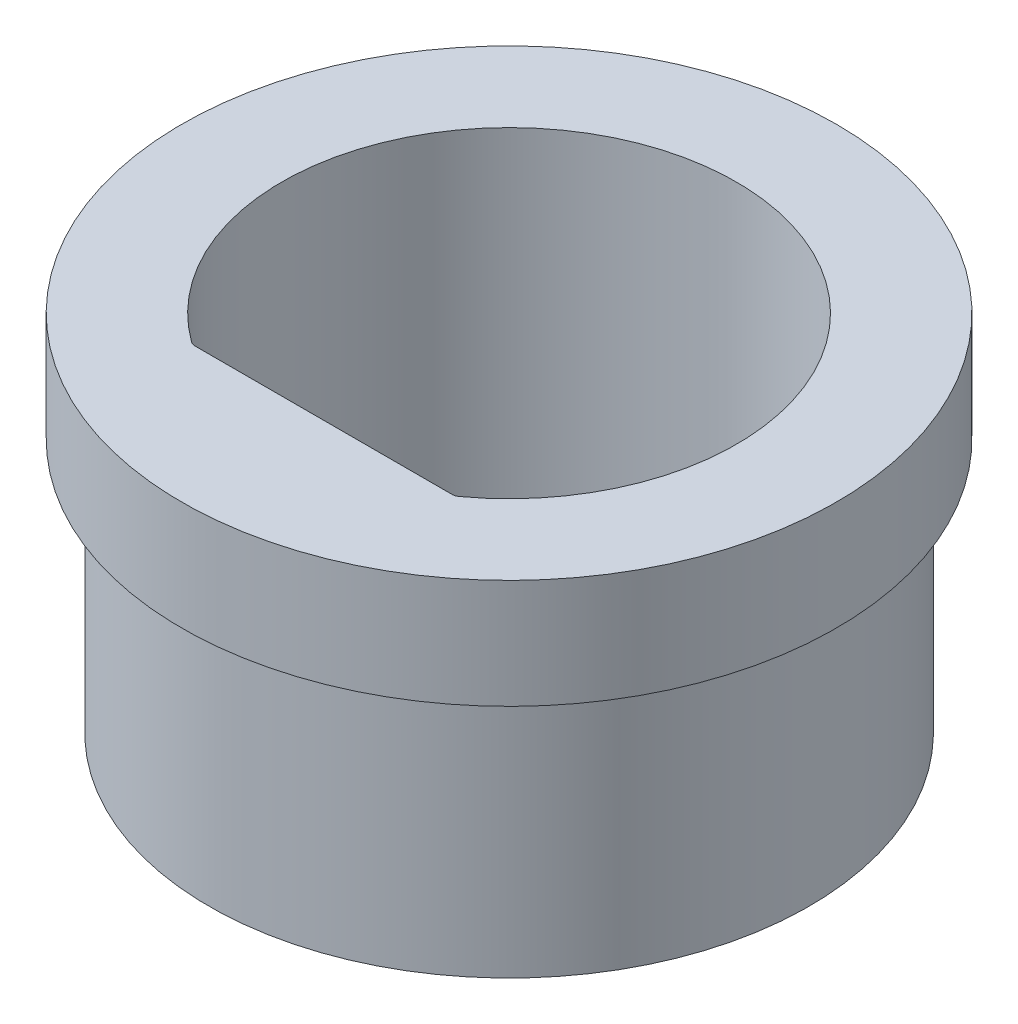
from build123d import *

# Parameters (mm, degrees)
ENL_V_MAT_EXTRU_1_DEPTH = 33.372828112
CONG_1_R                = 0.5


with BuildPart() as part:
    # Esquisse1 → R_volution1 (revolve)
    with BuildSketch(Plane.XY, mode=Mode.PRIVATE) as r_volution1_sk:
        Polygon((0, 20), (0, 0), (16.5, 0), (16.5, 14), (18, 14), (18, 20), align=None)
    revolve(r_volution1_sk.sketch.rotate(Axis((0, 0, 0), (0, 1, 0)), 90), axis=Axis((0, 0, 0), (0, 1, 0)))

    # Esquisse2 → Enl_v. mat.-Extru.1 (cut, through all)
    with BuildSketch(Plane(origin=(0, 20, 0), x_dir=(-1, 0, 0), z_dir=(0, 1, 0))):
        with BuildLine():
            Line((-7.22564876, 10.2), (7.22564876, 10.2))
            ThreePointArc((7.22564876, 10.2), (0, -12.5), (-7.22564876, 10.2))
        make_face()
    extrude(amount=-ENL_V_MAT_EXTRU_1_DEPTH, mode=Mode.SUBTRACT)

    # Cong_1
    cong_1_edges = [part.edges().sort_by_distance(p)[0] for p in [
        (-7.22564876, 10, 10.2),
        (7.22564876, 10, 10.2),
    ]]
    fillet(cong_1_edges, radius=CONG_1_R)


solid = part.part
